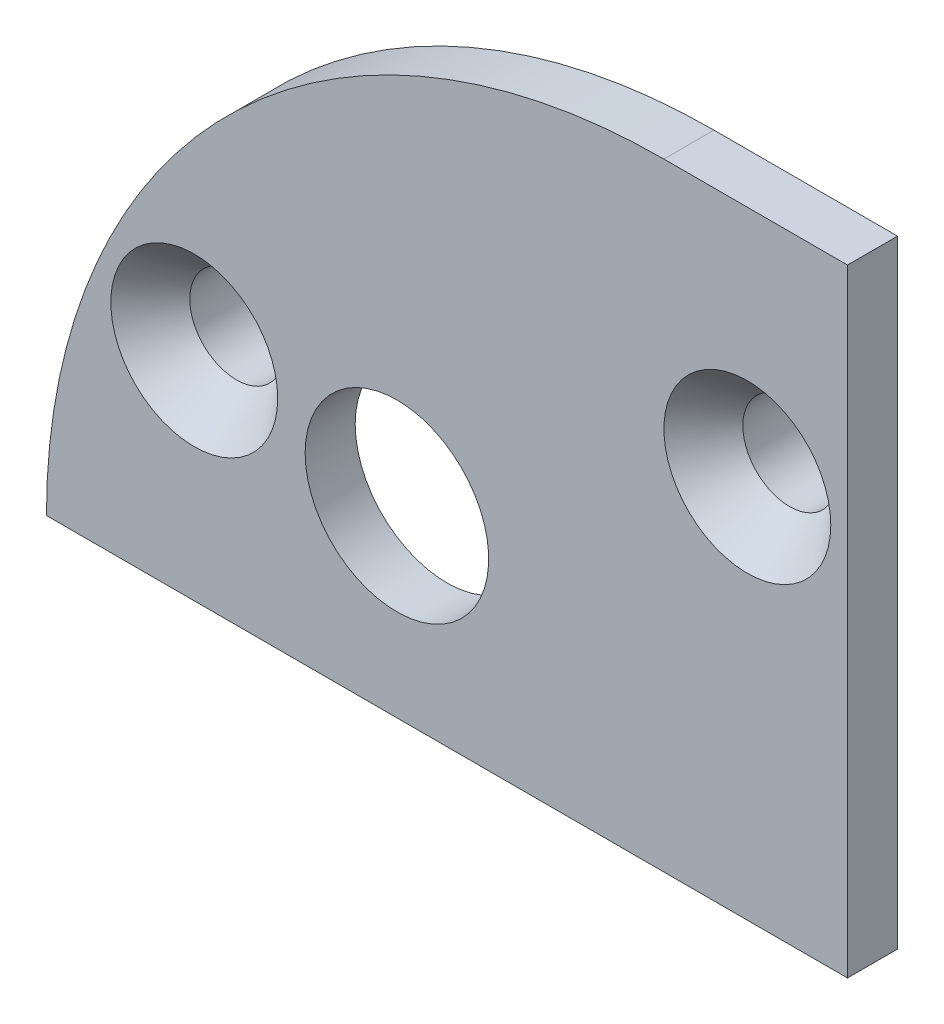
ISO-10303-21;
HEADER;
FILE_DESCRIPTION(('STEP AP214'),'2;1');
FILE_NAME('part.step','',(''),(''),'','','');
FILE_SCHEMA(('AUTOMOTIVE_DESIGN { 1 0 10303 214 1 1 1 1 }'));
ENDSEC;
DATA;
#1=APPLICATION_CONTEXT('core data for automotive mechanical design processes');
#2=APPLICATION_PROTOCOL_DEFINITION('international standard','automotive_design',2000,#1);
#3=PRODUCT_CONTEXT('',#1,'mechanical');
#4=PRODUCT('Part','Part','',(#3));
#5=PRODUCT_RELATED_PRODUCT_CATEGORY('part','',(#4));
#6=PRODUCT_DEFINITION_FORMATION('','',#4);
#7=PRODUCT_DEFINITION_CONTEXT('part definition',#1,'design');
#8=PRODUCT_DEFINITION('design','',#6,#7);
#9=PRODUCT_DEFINITION_SHAPE('','',#8);
#10=(LENGTH_UNIT() NAMED_UNIT(*) SI_UNIT(.MILLI.,.METRE.));
#11=(NAMED_UNIT(*) PLANE_ANGLE_UNIT() SI_UNIT($,.RADIAN.));
#12=(NAMED_UNIT(*) SI_UNIT($,.STERADIAN.) SOLID_ANGLE_UNIT());
#13=UNCERTAINTY_MEASURE_WITH_UNIT(LENGTH_MEASURE(1.E-05),#10,'distance_accuracy_value','');
#14=(GEOMETRIC_REPRESENTATION_CONTEXT(3) GLOBAL_UNCERTAINTY_ASSIGNED_CONTEXT((#13)) GLOBAL_UNIT_ASSIGNED_CONTEXT((#10,
#11,#12)) REPRESENTATION_CONTEXT('',''));
#15=CARTESIAN_POINT('',(0.,0.,0.));
#16=DIRECTION('',(0.,0.,1.));
#17=DIRECTION('',(1.,0.,0.));
#18=AXIS2_PLACEMENT_3D('',#15,#16,#17);
#19=CARTESIAN_POINT('',(-19.5712472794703,6.49999999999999,-0.499999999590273));
#20=DIRECTION('',(0.,0.,1.));
#21=DIRECTION('',(1.,0.,0.));
#22=AXIS2_PLACEMENT_3D('',#19,#20,#21);
#23=CONICAL_SURFACE('',#22,2.49999999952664,0.785398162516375);
#24=CARTESIAN_POINT('',(-19.5712472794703,6.49999999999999,-0.5));
#25=DIRECTION('',(0.,0.,-1.));
#26=DIRECTION('',(-1.,0.,0.));
#27=AXIS2_PLACEMENT_3D('',#24,#25,#26);
#28=CIRCLE('',#27,2.5);
#29=CARTESIAN_POINT('',(-22.0712472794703,6.49999999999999,-0.5));
#30=VERTEX_POINT('',#29);
#31=EDGE_CURVE('E135',#30,#30,#28,.F.);
#32=ORIENTED_EDGE('',*,*,#31,.F.);
#33=EDGE_LOOP('',(#32));
#34=FACE_BOUND('',#33,.T.);
#35=CARTESIAN_POINT('',(-19.5712472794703,6.49999999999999,-1.50000000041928));
#36=DIRECTION('',(0.,0.,1.));
#37=DIRECTION('',(1.,0.,0.));
#38=AXIS2_PLACEMENT_3D('',#35,#36,#37);
#39=CIRCLE('',#38,1.50000000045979);
#40=CARTESIAN_POINT('',(-18.0712472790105,6.49999999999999,-1.50000000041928));
#41=VERTEX_POINT('',#40);
#42=EDGE_CURVE('E19',#41,#41,#39,.T.);
#43=ORIENTED_EDGE('',*,*,#42,.T.);
#44=EDGE_LOOP('',(#43));
#45=FACE_BOUND('',#44,.T.);
#46=ADVANCED_FACE('F15',(#34,#45),#23,.T.);
#47=CARTESIAN_POINT('',(-3.00000000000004,11.5,-0.499999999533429));
#48=DIRECTION('',(0.,0.,1.));
#49=DIRECTION('',(1.,0.,0.));
#50=AXIS2_PLACEMENT_3D('',#47,#48,#49);
#51=CONICAL_SURFACE('',#50,2.49999999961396,0.785398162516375);
#52=CARTESIAN_POINT('',(-3.00000000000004,11.5,-0.5));
#53=DIRECTION('',(0.,0.,-1.));
#54=DIRECTION('',(-1.,0.,0.));
#55=AXIS2_PLACEMENT_3D('',#52,#53,#54);
#56=CIRCLE('',#55,2.5);
#57=CARTESIAN_POINT('',(-5.50000000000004,11.5,-0.5));
#58=VERTEX_POINT('',#57);
#59=EDGE_CURVE('E132',#58,#58,#56,.F.);
#60=ORIENTED_EDGE('',*,*,#59,.F.);
#61=EDGE_LOOP('',(#60));
#62=FACE_BOUND('',#61,.T.);
#63=CARTESIAN_POINT('',(-3.00000000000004,11.5,-1.50000000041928));
#64=DIRECTION('',(0.,0.,1.));
#65=DIRECTION('',(1.,0.,0.));
#66=AXIS2_PLACEMENT_3D('',#63,#64,#65);
#67=CIRCLE('',#66,1.50000000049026);
#68=CARTESIAN_POINT('',(-1.49999999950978,11.5,-1.50000000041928));
#69=VERTEX_POINT('',#68);
#70=EDGE_CURVE('E133',#69,#69,#67,.T.);
#71=ORIENTED_EDGE('',*,*,#70,.T.);
#72=EDGE_LOOP('',(#71));
#73=FACE_BOUND('',#72,.T.);
#74=ADVANCED_FACE('F147',(#62,#73),#51,.T.);
#75=CARTESIAN_POINT('',(-19.5712472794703,6.49999999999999,-1.5));
#76=DIRECTION('',(0.,0.,1.));
#77=DIRECTION('',(1.,0.,0.));
#78=AXIS2_PLACEMENT_3D('',#75,#76,#77);
#79=PLANE('',#78);
#80=CARTESIAN_POINT('',(-19.5712472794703,6.49999999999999,-1.5));
#81=DIRECTION('',(0.,0.,-1.));
#82=DIRECTION('',(-1.,0.,0.));
#83=AXIS2_PLACEMENT_3D('',#80,#81,#82);
#84=CIRCLE('',#83,1.4);
#85=CARTESIAN_POINT('',(-20.9712472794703,6.49999999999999,-1.5));
#86=VERTEX_POINT('',#85);
#87=EDGE_CURVE('E130',#86,#86,#84,.F.);
#88=ORIENTED_EDGE('',*,*,#87,.T.);
#89=EDGE_LOOP('',(#88));
#90=FACE_BOUND('',#89,.T.);
#91=ORIENTED_EDGE('',*,*,#42,.F.);
#92=EDGE_LOOP('',(#91));
#93=FACE_BOUND('',#92,.T.);
#94=ADVANCED_FACE('F144',(#90,#93),#79,.F.);
#95=CARTESIAN_POINT('',(-3.00000000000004,11.5,-1.5));
#96=DIRECTION('',(0.,0.,1.));
#97=DIRECTION('',(1.,0.,0.));
#98=AXIS2_PLACEMENT_3D('',#95,#96,#97);
#99=PLANE('',#98);
#100=CARTESIAN_POINT('',(-3.00000000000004,11.5,-1.5));
#101=DIRECTION('',(0.,0.,-1.));
#102=DIRECTION('',(-1.,0.,0.));
#103=AXIS2_PLACEMENT_3D('',#100,#101,#102);
#104=CIRCLE('',#103,1.4);
#105=CARTESIAN_POINT('',(-4.40000000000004,11.5,-1.5));
#106=VERTEX_POINT('',#105);
#107=EDGE_CURVE('E127',#106,#106,#104,.F.);
#108=ORIENTED_EDGE('',*,*,#107,.T.);
#109=EDGE_LOOP('',(#108));
#110=FACE_BOUND('',#109,.T.);
#111=ORIENTED_EDGE('',*,*,#70,.F.);
#112=EDGE_LOOP('',(#111));
#113=FACE_BOUND('',#112,.T.);
#114=ADVANCED_FACE('F146',(#110,#113),#99,.F.);
#115=CARTESIAN_POINT('',(-19.5712472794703,6.49999999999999,0.));
#116=DIRECTION('',(0.,0.,-1.));
#117=DIRECTION('',(-1.,0.,0.));
#118=AXIS2_PLACEMENT_3D('',#115,#116,#117);
#119=CYLINDRICAL_SURFACE('',#118,2.5);
#120=ORIENTED_EDGE('',*,*,#31,.T.);
#121=EDGE_LOOP('',(#120));
#122=FACE_BOUND('',#121,.T.);
#123=CARTESIAN_POINT('',(-19.5712472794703,6.49999999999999,0.));
#124=DIRECTION('',(0.,0.,-1.));
#125=DIRECTION('',(-1.,0.,0.));
#126=AXIS2_PLACEMENT_3D('',#123,#124,#125);
#127=CIRCLE('',#126,2.5);
#128=CARTESIAN_POINT('',(-22.0712472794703,6.49999999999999,0.));
#129=VERTEX_POINT('',#128);
#130=EDGE_CURVE('E124',#129,#129,#127,.T.);
#131=ORIENTED_EDGE('',*,*,#130,.T.);
#132=EDGE_LOOP('',(#131));
#133=FACE_BOUND('',#132,.T.);
#134=ADVANCED_FACE('F155',(#122,#133),#119,.T.);
#135=CARTESIAN_POINT('',(-3.00000000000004,11.5,0.));
#136=DIRECTION('',(0.,0.,-1.));
#137=DIRECTION('',(-1.,0.,0.));
#138=AXIS2_PLACEMENT_3D('',#135,#136,#137);
#139=CYLINDRICAL_SURFACE('',#138,2.5);
#140=ORIENTED_EDGE('',*,*,#59,.T.);
#141=EDGE_LOOP('',(#140));
#142=FACE_BOUND('',#141,.T.);
#143=CARTESIAN_POINT('',(-3.00000000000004,11.5,0.));
#144=DIRECTION('',(0.,0.,-1.));
#145=DIRECTION('',(-1.,0.,0.));
#146=AXIS2_PLACEMENT_3D('',#143,#144,#145);
#147=CIRCLE('',#146,2.5);
#148=CARTESIAN_POINT('',(-5.50000000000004,11.5,0.));
#149=VERTEX_POINT('',#148);
#150=EDGE_CURVE('E105',#149,#149,#147,.T.);
#151=ORIENTED_EDGE('',*,*,#150,.T.);
#152=EDGE_LOOP('',(#151));
#153=FACE_BOUND('',#152,.T.);
#154=ADVANCED_FACE('F176',(#142,#153),#139,.T.);
#155=CARTESIAN_POINT('',(-19.5712472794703,6.49999999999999,0.234594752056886));
#156=DIRECTION('',(0.,0.,-1.));
#157=DIRECTION('',(-1.,0.,0.));
#158=AXIS2_PLACEMENT_3D('',#155,#156,#157);
#159=CYLINDRICAL_SURFACE('',#158,1.4);
#160=CARTESIAN_POINT('',(-19.5712472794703,6.49999999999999,0.234594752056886));
#161=DIRECTION('',(0.,0.,1.));
#162=DIRECTION('',(1.,0.,0.));
#163=AXIS2_PLACEMENT_3D('',#160,#161,#162);
#164=CIRCLE('',#163,1.4);
#165=CARTESIAN_POINT('',(-18.1712472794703,6.49999999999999,0.234594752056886));
#166=VERTEX_POINT('',#165);
#167=EDGE_CURVE('E94',#166,#166,#164,.T.);
#168=ORIENTED_EDGE('',*,*,#167,.T.);
#169=EDGE_LOOP('',(#168));
#170=FACE_BOUND('',#169,.T.);
#171=ORIENTED_EDGE('',*,*,#87,.F.);
#172=EDGE_LOOP('',(#171));
#173=FACE_BOUND('',#172,.T.);
#174=ADVANCED_FACE('F172',(#170,#173),#159,.F.);
#175=CARTESIAN_POINT('',(-3.00000000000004,11.5,0.234594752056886));
#176=DIRECTION('',(0.,0.,-1.));
#177=DIRECTION('',(-1.,0.,0.));
#178=AXIS2_PLACEMENT_3D('',#175,#176,#177);
#179=CYLINDRICAL_SURFACE('',#178,1.4);
#180=CARTESIAN_POINT('',(-3.00000000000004,11.5,0.234594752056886));
#181=DIRECTION('',(0.,0.,1.));
#182=DIRECTION('',(1.,0.,0.));
#183=AXIS2_PLACEMENT_3D('',#180,#181,#182);
#184=CIRCLE('',#183,1.4);
#185=CARTESIAN_POINT('',(-1.60000000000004,11.5,0.234594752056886));
#186=VERTEX_POINT('',#185);
#187=EDGE_CURVE('E84',#186,#186,#184,.T.);
#188=ORIENTED_EDGE('',*,*,#187,.T.);
#189=EDGE_LOOP('',(#188));
#190=FACE_BOUND('',#189,.T.);
#191=ORIENTED_EDGE('',*,*,#107,.F.);
#192=EDGE_LOOP('',(#191));
#193=FACE_BOUND('',#192,.T.);
#194=ADVANCED_FACE('F175',(#190,#193),#179,.F.);
#195=CARTESIAN_POINT('',(-10.3541298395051,7.88749102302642,0.));
#196=DIRECTION('',(0.,0.,1.));
#197=DIRECTION('',(1.,0.,0.));
#198=AXIS2_PLACEMENT_3D('',#195,#196,#197);
#199=PLANE('',#198);
#200=CARTESIAN_POINT('',(-13.5,5.50000000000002,0.));
#201=DIRECTION('',(0.,0.,-1.));
#202=DIRECTION('',(-1.,0.,0.));
#203=AXIS2_PLACEMENT_3D('',#200,#201,#202);
#204=CIRCLE('',#203,2.75);
#205=CARTESIAN_POINT('',(-16.2500000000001,5.50000000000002,0.));
#206=VERTEX_POINT('',#205);
#207=EDGE_CURVE('E81',#206,#206,#204,.F.);
#208=ORIENTED_EDGE('',*,*,#207,.T.);
#209=EDGE_LOOP('',(#208));
#210=FACE_BOUND('',#209,.T.);
#211=ORIENTED_EDGE('',*,*,#150,.F.);
#212=EDGE_LOOP('',(#211));
#213=FACE_BOUND('',#212,.T.);
#214=ORIENTED_EDGE('',*,*,#130,.F.);
#215=EDGE_LOOP('',(#214));
#216=FACE_BOUND('',#215,.T.);
#217=DIRECTION('',(1.,0.,0.));
#218=VECTOR('',#217,1.);
#219=CARTESIAN_POINT('',(0.,0.,0.));
#220=LINE('',#219,#218);
#221=CARTESIAN_POINT('',(-24.,0.,0.));
#222=VERTEX_POINT('',#221);
#223=CARTESIAN_POINT('',(0.,0.,0.));
#224=VERTEX_POINT('',#223);
#225=EDGE_CURVE('E68',#222,#224,#220,.T.);
#226=ORIENTED_EDGE('',*,*,#225,.F.);
#227=CARTESIAN_POINT('',(-5.5,0.,0.));
#228=DIRECTION('',(0.,0.,1.));
#229=DIRECTION('',(1.,0.,0.));
#230=AXIS2_PLACEMENT_3D('',#227,#228,#229);
#231=CIRCLE('',#230,18.5);
#232=CARTESIAN_POINT('',(-5.50000000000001,18.5,0.));
#233=VERTEX_POINT('',#232);
#234=EDGE_CURVE('E95',#233,#222,#231,.T.);
#235=ORIENTED_EDGE('',*,*,#234,.F.);
#236=DIRECTION('',(1.,0.,0.));
#237=VECTOR('',#236,1.);
#238=CARTESIAN_POINT('',(-5.50000000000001,18.5,0.));
#239=LINE('',#238,#237);
#240=CARTESIAN_POINT('',(0.,18.5,0.));
#241=VERTEX_POINT('',#240);
#242=EDGE_CURVE('E49',#241,#233,#239,.F.);
#243=ORIENTED_EDGE('',*,*,#242,.F.);
#244=DIRECTION('',(0.,1.,0.));
#245=VECTOR('',#244,1.);
#246=CARTESIAN_POINT('',(0.,18.5,0.));
#247=LINE('',#246,#245);
#248=EDGE_CURVE('E57',#224,#241,#247,.T.);
#249=ORIENTED_EDGE('',*,*,#248,.F.);
#250=EDGE_LOOP('',(#226,#235,#243,#249));
#251=FACE_BOUND('',#250,.T.);
#252=ADVANCED_FACE('F179',(#210,#213,#216,#251),#199,.F.);
#253=CARTESIAN_POINT('',(0.,0.,0.));
#254=DIRECTION('',(0.,-1.,0.));
#255=DIRECTION('',(0.,0.,-1.));
#256=AXIS2_PLACEMENT_3D('',#253,#254,#255);
#257=PLANE('',#256);
#258=ORIENTED_EDGE('',*,*,#225,.T.);
#259=DIRECTION('',(0.,0.,-1.));
#260=VECTOR('',#259,1.);
#261=CARTESIAN_POINT('',(0.,0.,0.));
#262=LINE('',#261,#260);
#263=CARTESIAN_POINT('',(0.,0.,1.5));
#264=VERTEX_POINT('',#263);
#265=EDGE_CURVE('E61',#264,#224,#262,.T.);
#266=ORIENTED_EDGE('',*,*,#265,.F.);
#267=DIRECTION('',(1.,0.,0.));
#268=VECTOR('',#267,1.);
#269=CARTESIAN_POINT('',(-10.3541298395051,0.,1.5));
#270=LINE('',#269,#268);
#271=CARTESIAN_POINT('',(-24.,0.,1.5));
#272=VERTEX_POINT('',#271);
#273=EDGE_CURVE('E66',#272,#264,#270,.T.);
#274=ORIENTED_EDGE('',*,*,#273,.F.);
#275=DIRECTION('',(0.,0.,1.));
#276=VECTOR('',#275,1.);
#277=CARTESIAN_POINT('',(-24.,0.,0.));
#278=LINE('',#277,#276);
#279=EDGE_CURVE('E92',#222,#272,#278,.T.);
#280=ORIENTED_EDGE('',*,*,#279,.F.);
#281=EDGE_LOOP('',(#258,#266,#274,#280));
#282=FACE_BOUND('',#281,.T.);
#283=ADVANCED_FACE('F63',(#282),#257,.T.);
#284=CARTESIAN_POINT('',(0.,18.5,0.));
#285=DIRECTION('',(1.,0.,0.));
#286=DIRECTION('',(0.,0.,-1.));
#287=AXIS2_PLACEMENT_3D('',#284,#285,#286);
#288=PLANE('',#287);
#289=ORIENTED_EDGE('',*,*,#248,.T.);
#290=DIRECTION('',(0.,0.,1.));
#291=VECTOR('',#290,1.);
#292=CARTESIAN_POINT('',(0.,18.5,0.));
#293=LINE('',#292,#291);
#294=CARTESIAN_POINT('',(0.,18.5,1.5));
#295=VERTEX_POINT('',#294);
#296=EDGE_CURVE('E73',#295,#241,#293,.F.);
#297=ORIENTED_EDGE('',*,*,#296,.F.);
#298=DIRECTION('',(0.,1.,0.));
#299=VECTOR('',#298,1.);
#300=CARTESIAN_POINT('',(0.,7.88749102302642,1.5));
#301=LINE('',#300,#299);
#302=EDGE_CURVE('E71',#264,#295,#301,.T.);
#303=ORIENTED_EDGE('',*,*,#302,.F.);
#304=ORIENTED_EDGE('',*,*,#265,.T.);
#305=EDGE_LOOP('',(#289,#297,#303,#304));
#306=FACE_BOUND('',#305,.T.);
#307=ADVANCED_FACE('F72',(#306),#288,.T.);
#308=CARTESIAN_POINT('',(-5.50000000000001,18.5,0.));
#309=DIRECTION('',(0.,1.,0.));
#310=DIRECTION('',(0.,0.,1.));
#311=AXIS2_PLACEMENT_3D('',#308,#309,#310);
#312=PLANE('',#311);
#313=ORIENTED_EDGE('',*,*,#242,.T.);
#314=DIRECTION('',(0.,0.,1.));
#315=VECTOR('',#314,1.);
#316=CARTESIAN_POINT('',(-5.50000000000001,18.5,0.));
#317=LINE('',#316,#315);
#318=CARTESIAN_POINT('',(-5.50000000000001,18.5,1.5));
#319=VERTEX_POINT('',#318);
#320=EDGE_CURVE('E34',#319,#233,#317,.F.);
#321=ORIENTED_EDGE('',*,*,#320,.F.);
#322=DIRECTION('',(1.,0.,0.));
#323=VECTOR('',#322,1.);
#324=CARTESIAN_POINT('',(-10.3541298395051,18.5,1.5));
#325=LINE('',#324,#323);
#326=EDGE_CURVE('E76',#295,#319,#325,.F.);
#327=ORIENTED_EDGE('',*,*,#326,.F.);
#328=ORIENTED_EDGE('',*,*,#296,.T.);
#329=EDGE_LOOP('',(#313,#321,#327,#328));
#330=FACE_BOUND('',#329,.T.);
#331=ADVANCED_FACE('F190',(#330),#312,.T.);
#332=CARTESIAN_POINT('',(-5.5,0.,0.));
#333=DIRECTION('',(0.,0.,1.));
#334=DIRECTION('',(1.,0.,0.));
#335=AXIS2_PLACEMENT_3D('',#332,#333,#334);
#336=CYLINDRICAL_SURFACE('',#335,18.5);
#337=ORIENTED_EDGE('',*,*,#234,.T.);
#338=ORIENTED_EDGE('',*,*,#279,.T.);
#339=CARTESIAN_POINT('',(-5.5,0.,1.5));
#340=DIRECTION('',(0.,0.,1.));
#341=DIRECTION('',(1.,0.,0.));
#342=AXIS2_PLACEMENT_3D('',#339,#340,#341);
#343=CIRCLE('',#342,18.5);
#344=EDGE_CURVE('E80',#319,#272,#343,.T.);
#345=ORIENTED_EDGE('',*,*,#344,.F.);
#346=ORIENTED_EDGE('',*,*,#320,.T.);
#347=EDGE_LOOP('',(#337,#338,#345,#346));
#348=FACE_BOUND('',#347,.T.);
#349=ADVANCED_FACE('F183',(#348),#336,.T.);
#350=CARTESIAN_POINT('',(-19.5712472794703,6.49999999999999,1.5));
#351=DIRECTION('',(0.,0.,1.));
#352=DIRECTION('',(1.,0.,0.));
#353=AXIS2_PLACEMENT_3D('',#350,#351,#352);
#354=CONICAL_SURFACE('',#353,2.5,0.715584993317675);
#355=ORIENTED_EDGE('',*,*,#167,.F.);
#356=EDGE_LOOP('',(#355));
#357=FACE_BOUND('',#356,.T.);
#358=CARTESIAN_POINT('',(-19.5712472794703,6.49999999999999,1.5));
#359=DIRECTION('',(0.,0.,1.));
#360=DIRECTION('',(1.,0.,0.));
#361=AXIS2_PLACEMENT_3D('',#358,#359,#360);
#362=CIRCLE('',#361,2.5);
#363=CARTESIAN_POINT('',(-17.0712472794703,6.49999999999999,1.5));
#364=VERTEX_POINT('',#363);
#365=EDGE_CURVE('E116',#364,#364,#362,.F.);
#366=ORIENTED_EDGE('',*,*,#365,.F.);
#367=EDGE_LOOP('',(#366));
#368=FACE_BOUND('',#367,.T.);
#369=ADVANCED_FACE('F181',(#357,#368),#354,.F.);
#370=CARTESIAN_POINT('',(-3.00000000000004,11.5,1.5));
#371=DIRECTION('',(0.,0.,1.));
#372=DIRECTION('',(1.,0.,0.));
#373=AXIS2_PLACEMENT_3D('',#370,#371,#372);
#374=CONICAL_SURFACE('',#373,2.5,0.715584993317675);
#375=ORIENTED_EDGE('',*,*,#187,.F.);
#376=EDGE_LOOP('',(#375));
#377=FACE_BOUND('',#376,.T.);
#378=CARTESIAN_POINT('',(-3.00000000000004,11.5,1.5));
#379=DIRECTION('',(0.,0.,1.));
#380=DIRECTION('',(1.,0.,0.));
#381=AXIS2_PLACEMENT_3D('',#378,#379,#380);
#382=CIRCLE('',#381,2.5);
#383=CARTESIAN_POINT('',(-0.500000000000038,11.5,1.5));
#384=VERTEX_POINT('',#383);
#385=EDGE_CURVE('E25',#384,#384,#382,.F.);
#386=ORIENTED_EDGE('',*,*,#385,.F.);
#387=EDGE_LOOP('',(#386));
#388=FACE_BOUND('',#387,.T.);
#389=ADVANCED_FACE('F17',(#377,#388),#374,.F.);
#390=CARTESIAN_POINT('',(-13.5,5.50000000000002,1.5));
#391=DIRECTION('',(0.,0.,-1.));
#392=DIRECTION('',(-1.,0.,0.));
#393=AXIS2_PLACEMENT_3D('',#390,#391,#392);
#394=CYLINDRICAL_SURFACE('',#393,2.75);
#395=CARTESIAN_POINT('',(-13.5,5.50000000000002,1.5));
#396=DIRECTION('',(0.,0.,-1.));
#397=DIRECTION('',(-1.,0.,0.));
#398=AXIS2_PLACEMENT_3D('',#395,#396,#397);
#399=CIRCLE('',#398,2.75);
#400=CARTESIAN_POINT('',(-16.2500000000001,5.50000000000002,1.5));
#401=VERTEX_POINT('',#400);
#402=EDGE_CURVE('E10',#401,#401,#399,.T.);
#403=ORIENTED_EDGE('',*,*,#402,.F.);
#404=EDGE_LOOP('',(#403));
#405=FACE_BOUND('',#404,.T.);
#406=ORIENTED_EDGE('',*,*,#207,.F.);
#407=EDGE_LOOP('',(#406));
#408=FACE_BOUND('',#407,.T.);
#409=ADVANCED_FACE('F161',(#405,#408),#394,.F.);
#410=CARTESIAN_POINT('',(-10.3541298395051,7.88749102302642,1.5));
#411=DIRECTION('',(0.,0.,1.));
#412=DIRECTION('',(1.,0.,0.));
#413=AXIS2_PLACEMENT_3D('',#410,#411,#412);
#414=PLANE('',#413);
#415=ORIENTED_EDGE('',*,*,#402,.T.);
#416=EDGE_LOOP('',(#415));
#417=FACE_BOUND('',#416,.T.);
#418=ORIENTED_EDGE('',*,*,#385,.T.);
#419=EDGE_LOOP('',(#418));
#420=FACE_BOUND('',#419,.T.);
#421=ORIENTED_EDGE('',*,*,#365,.T.);
#422=EDGE_LOOP('',(#421));
#423=FACE_BOUND('',#422,.T.);
#424=ORIENTED_EDGE('',*,*,#326,.T.);
#425=ORIENTED_EDGE('',*,*,#344,.T.);
#426=ORIENTED_EDGE('',*,*,#273,.T.);
#427=ORIENTED_EDGE('',*,*,#302,.T.);
#428=EDGE_LOOP('',(#424,#425,#426,#427));
#429=FACE_BOUND('',#428,.T.);
#430=ADVANCED_FACE('F79',(#417,#420,#423,#429),#414,.T.);
#431=CLOSED_SHELL('',(#46,#74,#94,#114,#134,#154,#174,#194,#252,#283,#307,#331,#349,#369,#389,
#409,#430));
#432=MANIFOLD_SOLID_BREP('B1',#431);
#433=ADVANCED_BREP_SHAPE_REPRESENTATION('',(#18,#432),#14);
#434=SHAPE_DEFINITION_REPRESENTATION(#9,#433);
ENDSEC;
END-ISO-10303-21;
